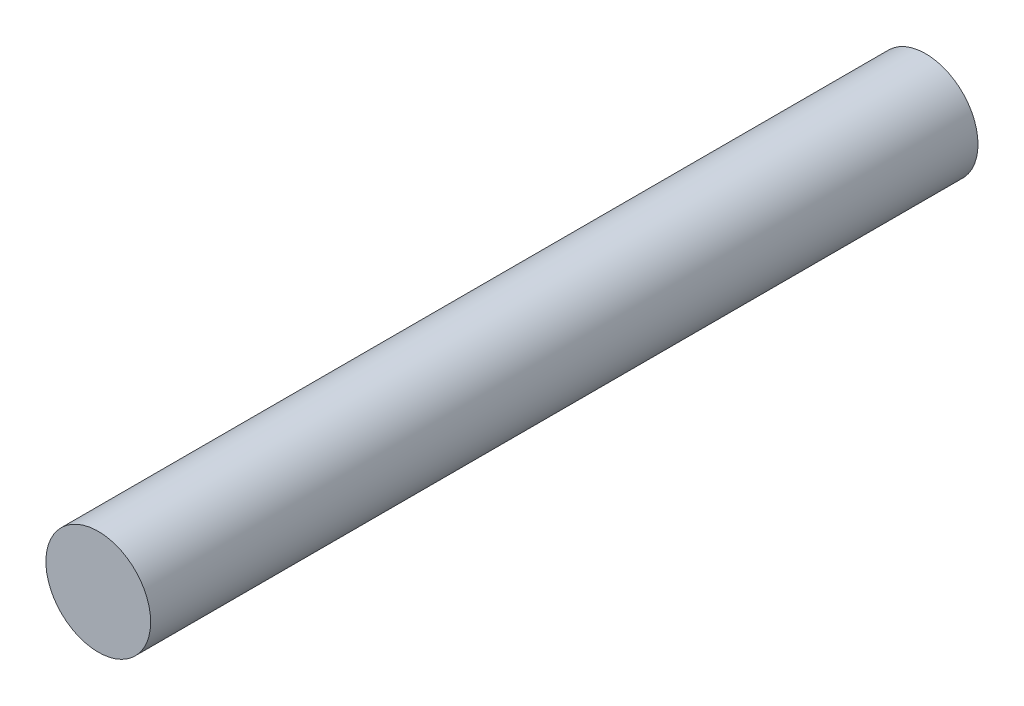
from build123d import *

# Parameters (mm, degrees)
SKETCH1_R           = 2
BOSS_EXTRUDE1_DEPTH = 15.8


with BuildPart() as part:
    # Sketch1 → Boss-Extrude1 (new, symmetric)
    with BuildSketch(Plane.XY):
        Circle(SKETCH1_R)
    extrude(amount=BOSS_EXTRUDE1_DEPTH, both=True)


solid = part.part
